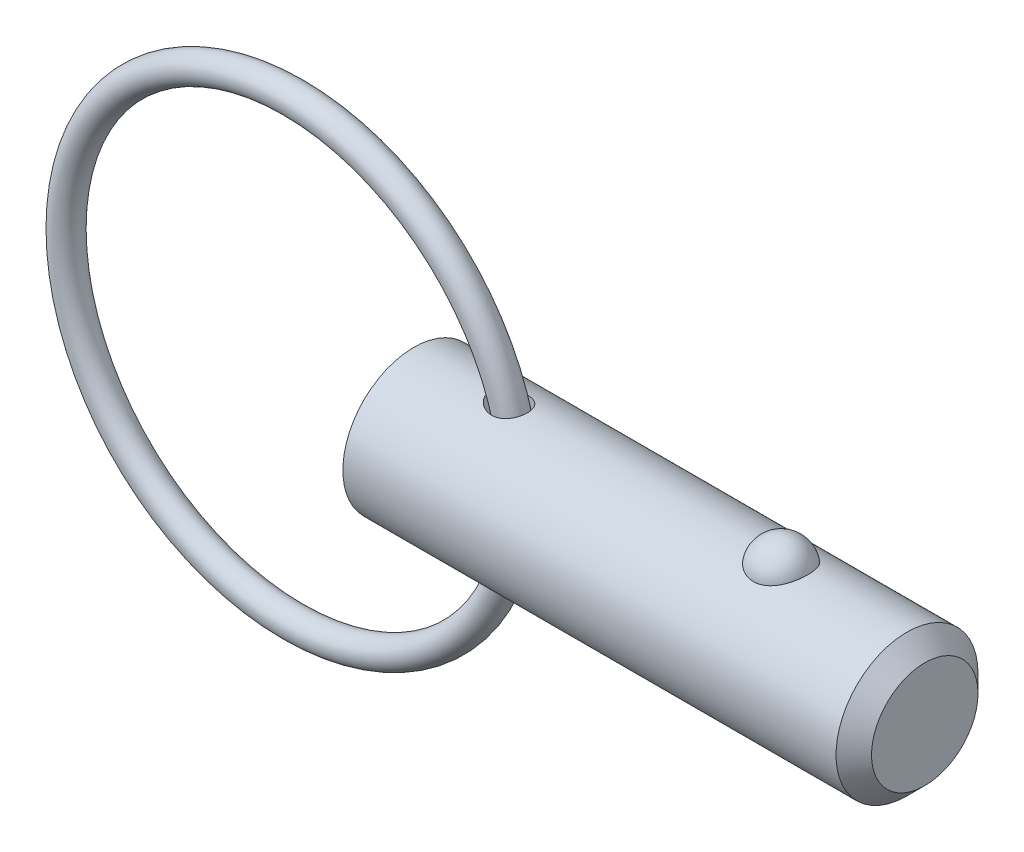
ISO-10303-21;
HEADER;
FILE_DESCRIPTION(('STEP AP214'),'2;1');
FILE_NAME('part.step','',(''),(''),'','','');
FILE_SCHEMA(('AUTOMOTIVE_DESIGN { 1 0 10303 214 1 1 1 1 }'));
ENDSEC;
DATA;
#1=APPLICATION_CONTEXT('core data for automotive mechanical design processes');
#2=APPLICATION_PROTOCOL_DEFINITION('international standard','automotive_design',2000,#1);
#3=PRODUCT_CONTEXT('',#1,'mechanical');
#4=PRODUCT('Part','Part','',(#3));
#5=PRODUCT_RELATED_PRODUCT_CATEGORY('part','',(#4));
#6=PRODUCT_DEFINITION_FORMATION('','',#4);
#7=PRODUCT_DEFINITION_CONTEXT('part definition',#1,'design');
#8=PRODUCT_DEFINITION('design','',#6,#7);
#9=PRODUCT_DEFINITION_SHAPE('','',#8);
#10=(LENGTH_UNIT() NAMED_UNIT(*) SI_UNIT(.MILLI.,.METRE.));
#11=(NAMED_UNIT(*) PLANE_ANGLE_UNIT() SI_UNIT($,.RADIAN.));
#12=(NAMED_UNIT(*) SI_UNIT($,.STERADIAN.) SOLID_ANGLE_UNIT());
#13=UNCERTAINTY_MEASURE_WITH_UNIT(LENGTH_MEASURE(1.E-05),#10,'distance_accuracy_value','');
#14=(GEOMETRIC_REPRESENTATION_CONTEXT(3) GLOBAL_UNCERTAINTY_ASSIGNED_CONTEXT((#13)) GLOBAL_UNIT_ASSIGNED_CONTEXT((#10,
#11,#12)) REPRESENTATION_CONTEXT('',''));
#15=CARTESIAN_POINT('',(0.,0.,0.));
#16=DIRECTION('',(0.,0.,1.));
#17=DIRECTION('',(1.,0.,0.));
#18=AXIS2_PLACEMENT_3D('',#15,#16,#17);
#19=CARTESIAN_POINT('',(-6.75433730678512,0.,0.));
#20=DIRECTION('',(0.,0.,1.));
#21=DIRECTION('',(1.,0.,0.));
#22=AXIS2_PLACEMENT_3D('',#19,#20,#21);
#23=TOROIDAL_SURFACE('',#22,12.7,0.794);
#24=CARTESIAN_POINT('',(6.73966269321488,0.,0.));
#25=VERTEX_POINT('',#24);
#26=VERTEX_LOOP('',#25);
#27=FACE_BOUND('',#26,.T.);
#28=ADVANCED_FACE('P0_F12',(#27),#23,.T.);
#29=CLOSED_SHELL('',(#28));
#30=MANIFOLD_SOLID_BREP('P0_B1',#29);
#31=CARTESIAN_POINT('',(0.,0.,0.));
#32=DIRECTION('',(1.,0.,0.));
#33=DIRECTION('',(0.,0.,-1.));
#34=AXIS2_PLACEMENT_3D('',#31,#32,#33);
#35=CYLINDRICAL_SURFACE('',#34,3.97);
#36=CARTESIAN_POINT('',(4.50613409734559,3.92152479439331,-0.618499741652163));
#37=CARTESIAN_POINT('',(4.54853517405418,3.91408351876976,-0.665679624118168));
#38=CARTESIAN_POINT('',(4.59520918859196,3.90637054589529,-0.709047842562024));
#39=CARTESIAN_POINT('',(4.69529850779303,3.89134328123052,-0.787367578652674));
#40=CARTESIAN_POINT('',(4.74872860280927,3.88402991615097,-0.822300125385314));
#41=CARTESIAN_POINT('',(4.86059505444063,3.87069188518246,-0.882953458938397));
#42=CARTESIAN_POINT('',(4.91902090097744,3.86466460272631,-0.908693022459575));
#43=CARTESIAN_POINT('',(5.03942053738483,3.85463812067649,-0.950329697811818));
#44=CARTESIAN_POINT('',(5.10139227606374,3.85063776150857,-0.966232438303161));
#45=CARTESIAN_POINT('',(5.22799334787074,3.84521819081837,-0.987584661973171));
#46=CARTESIAN_POINT('',(5.29264515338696,3.84382942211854,-0.992910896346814));
#47=CARTESIAN_POINT('',(5.4218778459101,3.84405510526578,-0.992040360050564));
#48=CARTESIAN_POINT('',(5.48645875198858,3.84566813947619,-0.985849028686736));
#49=CARTESIAN_POINT('',(5.60832575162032,3.85155853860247,-0.962561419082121));
#50=CARTESIAN_POINT('',(5.66579014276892,3.85562063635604,-0.946343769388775));
#51=CARTESIAN_POINT('',(5.77675338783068,3.86576598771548,-0.904004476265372));
#52=CARTESIAN_POINT('',(5.83025379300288,3.87184844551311,-0.877886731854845));
#53=CARTESIAN_POINT('',(5.92811265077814,3.88482601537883,-0.818464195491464));
#54=CARTESIAN_POINT('',(5.97284196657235,3.89164057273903,-0.785750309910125));
#55=CARTESIAN_POINT('',(6.05599619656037,3.90559314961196,-0.713164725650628));
#56=CARTESIAN_POINT('',(6.09442162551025,3.91273114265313,-0.673293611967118));
#57=CARTESIAN_POINT('',(6.16349552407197,3.92643411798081,-0.588089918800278));
#58=CARTESIAN_POINT('',(6.19423746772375,3.93300527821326,-0.542833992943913));
#59=CARTESIAN_POINT('',(6.24784048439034,3.94496273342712,-0.447731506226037));
#60=CARTESIAN_POINT('',(6.27070130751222,3.95034899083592,-0.3978847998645));
#61=CARTESIAN_POINT('',(6.30819009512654,3.95940331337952,-0.294515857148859));
#62=CARTESIAN_POINT('',(6.32274046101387,3.96305513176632,-0.240964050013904));
#63=CARTESIAN_POINT('',(6.34295490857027,3.96817541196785,-0.132107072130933));
#64=CARTESIAN_POINT('',(6.3486187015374,3.96964380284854,-0.0768018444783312));
#65=CARTESIAN_POINT('',(6.35094049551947,3.97024250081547,0.0343098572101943));
#66=CARTESIAN_POINT('',(6.34754972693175,3.96936014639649,0.0901174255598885));
#67=CARTESIAN_POINT('',(6.33173352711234,3.9653248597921,0.200354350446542));
#68=CARTESIAN_POINT('',(6.31930791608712,3.96217188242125,0.254783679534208));
#69=CARTESIAN_POINT('',(6.28569545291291,3.95393415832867,0.360736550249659));
#70=CARTESIAN_POINT('',(6.26450524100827,3.94884867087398,0.412258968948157));
#71=CARTESIAN_POINT('',(6.21385621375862,3.93730247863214,0.510898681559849));
#72=CARTESIAN_POINT('',(6.18439757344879,3.93084180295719,0.558016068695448));
#73=CARTESIAN_POINT('',(6.11807283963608,3.91729312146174,0.646300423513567));
#74=CARTESIAN_POINT('',(6.08123803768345,3.91020783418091,0.687491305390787));
#75=CARTESIAN_POINT('',(6.00105036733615,3.89618447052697,0.762970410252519));
#76=CARTESIAN_POINT('',(5.95769831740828,3.88924637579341,0.79725949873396));
#77=CARTESIAN_POINT('',(5.8661353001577,3.87636375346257,0.857702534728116));
#78=CARTESIAN_POINT('',(5.81797537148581,3.87041026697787,0.883931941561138));
#79=CARTESIAN_POINT('',(5.71784316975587,3.86006042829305,0.928089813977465));
#80=CARTESIAN_POINT('',(5.66587104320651,3.85566401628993,0.946018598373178));
#81=CARTESIAN_POINT('',(5.55935910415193,3.84884784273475,0.973381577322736));
#82=CARTESIAN_POINT('',(5.50480823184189,3.84643760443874,0.982774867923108));
#83=CARTESIAN_POINT('',(5.39486598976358,3.84381055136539,0.992999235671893));
#84=CARTESIAN_POINT('',(5.33947443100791,3.84359423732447,0.993828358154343));
#85=CARTESIAN_POINT('',(5.2264823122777,3.84533176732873,0.987084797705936));
#86=CARTESIAN_POINT('',(5.16890896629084,3.84739412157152,0.979092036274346));
#87=CARTESIAN_POINT('',(5.05572652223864,3.85355237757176,0.954563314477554));
#88=CARTESIAN_POINT('',(5.00011821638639,3.85764908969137,0.938023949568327));
#89=CARTESIAN_POINT('',(4.88760177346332,3.86780726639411,0.895259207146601));
#90=CARTESIAN_POINT('',(4.83096658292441,3.87400321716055,0.868345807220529));
#91=CARTESIAN_POINT('',(4.72283286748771,3.88749324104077,0.805802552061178));
#92=CARTESIAN_POINT('',(4.6713374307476,3.89478796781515,0.770167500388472));
#93=CARTESIAN_POINT('',(4.57320957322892,3.90992457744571,0.689306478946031));
#94=CARTESIAN_POINT('',(4.52683185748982,3.91777672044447,0.643771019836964));
#95=CARTESIAN_POINT('',(4.44324307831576,3.93275681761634,0.544809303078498));
#96=CARTESIAN_POINT('',(4.40602610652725,3.939885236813,0.491388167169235));
#97=CARTESIAN_POINT('',(4.34571986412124,3.95183347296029,0.382912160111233));
#98=CARTESIAN_POINT('',(4.32168268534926,3.95680025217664,0.328404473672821));
#99=CARTESIAN_POINT('',(4.28478280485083,3.96454157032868,0.215602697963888));
#100=CARTESIAN_POINT('',(4.27190231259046,3.96731959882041,0.157314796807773));
#101=CARTESIAN_POINT('',(4.25937356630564,3.97002560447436,0.0481762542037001));
#102=CARTESIAN_POINT('',(4.25802727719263,3.97031923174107,-0.00247526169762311));
#103=CARTESIAN_POINT('',(4.26422295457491,3.96897737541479,-0.103210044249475));
#104=CARTESIAN_POINT('',(4.27176468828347,3.96734194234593,-0.153293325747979));
#105=CARTESIAN_POINT('',(4.29457390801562,3.96248430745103,-0.248530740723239));
#106=CARTESIAN_POINT('',(4.30937736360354,3.95935769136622,-0.293803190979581));
#107=CARTESIAN_POINT('',(4.34569993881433,3.95187968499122,-0.381417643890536));
#108=CARTESIAN_POINT('',(4.36721517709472,3.94752900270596,-0.42376132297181));
#109=CARTESIAN_POINT('',(4.40821696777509,3.93952317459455,-0.491758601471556));
#110=CARTESIAN_POINT('',(4.42613511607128,3.93609353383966,-0.518404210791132));
#111=CARTESIAN_POINT('',(4.46438343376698,3.92897396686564,-0.569857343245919));
#112=CARTESIAN_POINT('',(4.48471350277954,3.92528405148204,-0.594664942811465));
#113=CARTESIAN_POINT('',(4.50613409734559,3.92152479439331,-0.618499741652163));
#114=B_SPLINE_CURVE_WITH_KNOTS('',3,(#36,#37,#38,#39,#40,#41,#42,#43,#44,#45,#46,#47,#48,#49,
#50,#51,#52,#53,#54,#55,#56,#57,#58,#59,#60,#61,#62,#63,#64,#65,#66,#67,#68,#69,#70,#71,#72,#73,
#74,#75,#76,#77,#78,#79,#80,#81,#82,#83,#84,#85,#86,#87,#88,#89,#90,#91,#92,#93,#94,#95,#96,#97,
#98,#99,#100,#101,#102,#103,#104,#105,#106,#107,#108,#109,#110,#111,#112,#113),.UNSPECIFIED.,
.T.,.F.,(4,2,2,2,2,2,2,2,2,2,2,2,2,2,2,2,2,2,2,2,2,2,2,2,2,2,2,2,2,2,2,2,2,2,2,2,2,2,4),(0.,
0.191481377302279,0.383389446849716,0.574903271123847,0.766307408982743,0.959929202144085,
1.15345957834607,1.33205157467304,1.51057330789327,1.67726576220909,1.84394459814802,
2.00848443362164,2.17302948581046,2.33908685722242,2.50514962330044,2.6721086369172,
2.83907097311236,3.00609737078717,3.17312023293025,3.33944900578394,3.5057569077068,
3.67045663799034,3.83515004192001,4.00062859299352,4.16614491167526,4.33989638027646,
4.51371711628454,4.70191549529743,4.8902262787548,5.08559712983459,5.28084164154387,
5.45908728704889,5.63704817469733,5.78825771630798,5.93946329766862,6.08206496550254,
6.22458432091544,6.32132279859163,6.41805725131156),.UNSPECIFIED.);
#115=CARTESIAN_POINT('',(4.50613409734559,3.92152479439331,-0.618499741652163));
#116=VERTEX_POINT('',#115);
#117=EDGE_CURVE('P1_E40',#116,#116,#114,.T.);
#118=ORIENTED_EDGE('',*,*,#117,.T.);
#119=EDGE_LOOP('',(#118));
#120=FACE_BOUND('',#119,.T.);
#121=CARTESIAN_POINT('',(27.5875,0.,0.));
#122=DIRECTION('',(1.,0.,0.));
#123=DIRECTION('',(0.,0.,-1.));
#124=AXIS2_PLACEMENT_3D('',#121,#122,#123);
#125=CIRCLE('',#124,3.97);
#126=CARTESIAN_POINT('',(27.5875,0.,-3.97));
#127=VERTEX_POINT('',#126);
#128=EDGE_CURVE('P1_E25',#127,#127,#125,.T.);
#129=ORIENTED_EDGE('',*,*,#128,.F.);
#130=EDGE_LOOP('',(#129));
#131=FACE_BOUND('',#130,.T.);
#132=CARTESIAN_POINT('',(0.,0.,0.));
#133=DIRECTION('',(1.,0.,0.));
#134=DIRECTION('',(0.,0.,-1.));
#135=AXIS2_PLACEMENT_3D('',#132,#133,#134);
#136=CIRCLE('',#135,3.97);
#137=CARTESIAN_POINT('',(0.,0.,-3.97));
#138=VERTEX_POINT('',#137);
#139=EDGE_CURVE('P1_E9',#138,#138,#136,.T.);
#140=ORIENTED_EDGE('',*,*,#139,.T.);
#141=EDGE_LOOP('',(#140));
#142=FACE_BOUND('',#141,.T.);
#143=CARTESIAN_POINT('',(20.5451922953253,3.65715365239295,1.54470941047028));
#144=CARTESIAN_POINT('',(20.4652448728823,3.65716001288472,1.54470290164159));
#145=CARTESIAN_POINT('',(20.3851650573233,3.65987074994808,1.53832549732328));
#146=CARTESIAN_POINT('',(20.2272374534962,3.6704221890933,1.51297018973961));
#147=CARTESIAN_POINT('',(20.1493961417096,3.67827646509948,1.49395894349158));
#148=CARTESIAN_POINT('',(19.9984614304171,3.69818848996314,1.44395950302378));
#149=CARTESIAN_POINT('',(19.9253560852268,3.71023513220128,1.41300293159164));
#150=CARTESIAN_POINT('',(19.7855630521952,3.7372183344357,1.34000212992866));
#151=CARTESIAN_POINT('',(19.7188725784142,3.75215363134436,1.29796274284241));
#152=CARTESIAN_POINT('',(19.5914886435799,3.78384968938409,1.20248834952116));
#153=CARTESIAN_POINT('',(19.5310299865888,3.80065129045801,1.14875388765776));
#154=CARTESIAN_POINT('',(19.4196942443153,3.83398532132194,1.03205417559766));
#155=CARTESIAN_POINT('',(19.3688200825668,3.85051766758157,0.969086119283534));
#156=CARTESIAN_POINT('',(19.2756321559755,3.88238608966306,0.832526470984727));
#157=CARTESIAN_POINT('',(19.2337961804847,3.89763698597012,0.758588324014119));
#158=CARTESIAN_POINT('',(19.1625108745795,3.92451063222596,0.604352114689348));
#159=CARTESIAN_POINT('',(19.1330623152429,3.93613315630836,0.524053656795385));
#160=CARTESIAN_POINT('',(19.0868927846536,3.95467606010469,0.358403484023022));
#161=CARTESIAN_POINT('',(19.0703127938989,3.96154426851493,0.273006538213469));
#162=CARTESIAN_POINT('',(19.050756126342,3.96967008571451,0.100408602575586));
#163=CARTESIAN_POINT('',(19.0477789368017,3.97092790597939,0.0132076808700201));
#164=CARTESIAN_POINT('',(19.0554587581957,3.96771794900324,-0.15984454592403));
#165=CARTESIAN_POINT('',(19.0660164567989,3.96329187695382,-0.245701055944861));
#166=CARTESIAN_POINT('',(19.1003800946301,3.94923163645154,-0.414277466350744));
#167=CARTESIAN_POINT('',(19.1241862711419,3.9395973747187,-0.496997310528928));
#168=CARTESIAN_POINT('',(19.1846114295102,3.91607752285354,-0.657113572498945));
#169=CARTESIAN_POINT('',(19.2212495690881,3.90218558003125,-0.734501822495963));
#170=CARTESIAN_POINT('',(19.3065935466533,3.87158287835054,-0.881704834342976));
#171=CARTESIAN_POINT('',(19.3553004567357,3.8548718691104,-0.95151892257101));
#172=CARTESIAN_POINT('',(19.4641161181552,3.82028735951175,-1.08208159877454));
#173=CARTESIAN_POINT('',(19.5242955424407,3.80240713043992,-1.14276958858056));
#174=CARTESIAN_POINT('',(19.654493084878,3.76758161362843,-1.2528243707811));
#175=CARTESIAN_POINT('',(19.7245105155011,3.75063626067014,-1.30219195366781));
#176=CARTESIAN_POINT('',(19.87118160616,3.71998948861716,-1.38729709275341));
#177=CARTESIAN_POINT('',(19.9476813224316,3.70623183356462,-1.42327904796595));
#178=CARTESIAN_POINT('',(20.1062981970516,3.68323188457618,-1.48178996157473));
#179=CARTESIAN_POINT('',(20.1884132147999,3.67398788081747,-1.5043240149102));
#180=CARTESIAN_POINT('',(20.3514810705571,3.6615216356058,-1.53440939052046));
#181=CARTESIAN_POINT('',(20.4322840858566,3.65801951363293,-1.54265826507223));
#182=CARTESIAN_POINT('',(20.5942085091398,3.65657341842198,-1.5460842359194));
#183=CARTESIAN_POINT('',(20.6753298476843,3.65862829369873,-1.54126404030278));
#184=CARTESIAN_POINT('',(20.8328122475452,3.66788969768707,-1.51908474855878));
#185=CARTESIAN_POINT('',(20.9092422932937,3.67492621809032,-1.50213925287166));
#186=CARTESIAN_POINT('',(21.0580412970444,3.69318404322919,-1.45666982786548));
#187=CARTESIAN_POINT('',(21.1304099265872,3.70440568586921,-1.42814496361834));
#188=CARTESIAN_POINT('',(21.2708029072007,3.73012749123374,-1.35956319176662));
#189=CARTESIAN_POINT('',(21.3387000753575,3.74469307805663,-1.31927107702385));
#190=CARTESIAN_POINT('',(21.4668649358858,3.77545272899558,-1.22847440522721));
#191=CARTESIAN_POINT('',(21.5271308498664,3.79164717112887,-1.17796747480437));
#192=CARTESIAN_POINT('',(21.6416346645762,3.82490325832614,-1.06519260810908));
#193=CARTESIAN_POINT('',(21.6954137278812,3.84196735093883,-1.00245914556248));
#194=CARTESIAN_POINT('',(21.7920988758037,3.87439863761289,-0.868715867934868));
#195=CARTESIAN_POINT('',(21.8350030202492,3.88976552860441,-0.797704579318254));
#196=CARTESIAN_POINT('',(21.910266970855,3.91771381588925,-0.646896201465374));
#197=CARTESIAN_POINT('',(21.9422532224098,3.93019255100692,-0.566893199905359));
#198=CARTESIAN_POINT('',(21.9931101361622,3.95043886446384,-0.402255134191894));
#199=CARTESIAN_POINT('',(22.0119807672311,3.95820643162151,-0.317620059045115));
#200=CARTESIAN_POINT('',(22.0362162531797,3.96823733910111,-0.146156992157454));
#201=CARTESIAN_POINT('',(22.0415874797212,3.970503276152,-0.0593300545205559));
#202=CARTESIAN_POINT('',(22.0387309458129,3.96930811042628,0.114057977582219));
#203=CARTESIAN_POINT('',(22.0305035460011,3.9658471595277,0.200619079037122));
#204=CARTESIAN_POINT('',(22.0007063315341,3.95358562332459,0.370506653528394));
#205=CARTESIAN_POINT('',(21.9792129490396,3.94481563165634,0.453848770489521));
#206=CARTESIAN_POINT('',(21.9233839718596,3.92284586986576,0.615497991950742));
#207=CARTESIAN_POINT('',(21.8890474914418,3.90964579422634,0.693804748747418));
#208=CARTESIAN_POINT('',(21.8079702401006,3.88006987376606,0.843703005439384));
#209=CARTESIAN_POINT('',(21.7611536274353,3.86367478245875,0.915249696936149));
#210=CARTESIAN_POINT('',(21.6561897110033,3.82949741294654,1.04910810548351));
#211=CARTESIAN_POINT('',(21.5980428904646,3.81171519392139,1.11142021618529));
#212=CARTESIAN_POINT('',(21.4717433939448,3.77673366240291,1.22503948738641));
#213=CARTESIAN_POINT('',(21.4035970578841,3.75953398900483,1.2763535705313));
#214=CARTESIAN_POINT('',(21.2589009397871,3.72770506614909,1.36653336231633));
#215=CARTESIAN_POINT('',(21.182348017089,3.71307678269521,1.40539439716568));
#216=CARTESIAN_POINT('',(21.0257594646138,3.68864287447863,1.46830480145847));
#217=CARTESIAN_POINT('',(20.9459307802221,3.67869017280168,1.49281289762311));
#218=CARTESIAN_POINT('',(20.7829877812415,3.66414535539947,1.52817474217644));
#219=CARTESIAN_POINT('',(20.6998840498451,3.65953723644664,1.53906926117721));
#220=CARTESIAN_POINT('',(20.5927760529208,3.6573894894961,1.54414878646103));
#221=CARTESIAN_POINT('',(20.5689900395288,3.65715175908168,1.54471134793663));
#222=CARTESIAN_POINT('',(20.5451922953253,3.65715365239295,1.54470941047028));
#223=B_SPLINE_CURVE_WITH_KNOTS('',3,(#143,#144,#145,#146,#147,#148,#149,#150,#151,#152,#153,
#154,#155,#156,#157,#158,#159,#160,#161,#162,#163,#164,#165,#166,#167,#168,#169,#170,#171,#172,
#173,#174,#175,#176,#177,#178,#179,#180,#181,#182,#183,#184,#185,#186,#187,#188,#189,#190,#191,
#192,#193,#194,#195,#196,#197,#198,#199,#200,#201,#202,#203,#204,#205,#206,#207,#208,#209,#210,
#211,#212,#213,#214,#215,#216,#217,#218,#219,#220,#221,#222),.UNSPECIFIED.,.T.,.F.,(4,2,2,2,2,2,
2,2,2,2,2,2,2,2,2,2,2,2,2,2,2,2,2,2,2,2,2,2,2,2,2,2,2,2,2,2,2,2,2,4),(0.,0.239777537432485,
0.480190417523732,0.719971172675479,0.959647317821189,1.20639040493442,1.45320863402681,
1.7109367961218,1.96868099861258,2.22921052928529,2.4897302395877,2.74834928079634,
3.00697295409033,3.26598440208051,3.52501886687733,3.78570385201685,4.04637062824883,
4.30201257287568,4.55755760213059,4.80022994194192,5.04285200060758,5.27757006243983,
5.51230707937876,5.75210128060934,5.99195126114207,6.24392810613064,6.49594987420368,
6.75588818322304,7.0158271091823,7.27564332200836,7.53545264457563,7.79377886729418,
8.05212290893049,8.31207418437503,8.57201437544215,8.83179046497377,9.09166393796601,
9.34270057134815,9.59298357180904,9.66435753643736),.UNSPECIFIED.);
#224=CARTESIAN_POINT('',(20.5451922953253,3.65715365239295,1.54470941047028));
#225=VERTEX_POINT('',#224);
#226=EDGE_CURVE('P1_E34',#225,#225,#223,.T.);
#227=ORIENTED_EDGE('',*,*,#226,.T.);
#228=EDGE_LOOP('',(#227));
#229=FACE_BOUND('',#228,.T.);
#230=CARTESIAN_POINT('',(4.50613409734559,-3.92152479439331,-0.618499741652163));
#231=CARTESIAN_POINT('',(4.47063221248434,-3.92775524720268,-0.57899519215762));
#232=CARTESIAN_POINT('',(4.43810149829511,-3.93379908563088,-0.536794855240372));
#233=CARTESIAN_POINT('',(4.38017497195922,-3.94493883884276,-0.447628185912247));
#234=CARTESIAN_POINT('',(4.3547746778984,-3.95003534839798,-0.400664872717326));
#235=CARTESIAN_POINT('',(4.3122178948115,-3.95875465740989,-0.302642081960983));
#236=CARTESIAN_POINT('',(4.29511088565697,-3.96236859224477,-0.251560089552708));
#237=CARTESIAN_POINT('',(4.27046538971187,-3.96762012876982,-0.14703606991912));
#238=CARTESIAN_POINT('',(4.26292104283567,-3.96925894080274,-0.0935955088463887));
#239=CARTESIAN_POINT('',(4.25814817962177,-3.97029345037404,0.00916757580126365));
#240=CARTESIAN_POINT('',(4.26009234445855,-3.96986905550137,0.058451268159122));
#241=CARTESIAN_POINT('',(4.27229463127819,-3.96723648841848,0.15592126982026));
#242=CARTESIAN_POINT('',(4.28255257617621,-3.96502835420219,0.204107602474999));
#243=CARTESIAN_POINT('',(4.31040382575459,-3.95915538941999,0.296804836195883));
#244=CARTESIAN_POINT('',(4.32779766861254,-3.95553028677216,0.341378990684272));
#245=CARTESIAN_POINT('',(4.36906896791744,-3.94717481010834,0.427290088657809));
#246=CARTESIAN_POINT('',(4.39294824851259,-3.94244412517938,0.468626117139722));
#247=CARTESIAN_POINT('',(4.44891306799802,-3.93178155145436,0.551268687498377));
#248=CARTESIAN_POINT('',(4.48157347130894,-3.92577737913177,0.592175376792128));
#249=CARTESIAN_POINT('',(4.5525111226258,-3.91346489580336,0.668729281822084));
#250=CARTESIAN_POINT('',(4.59079150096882,-3.90715641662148,0.704373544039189));
#251=CARTESIAN_POINT('',(4.67775521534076,-3.89387548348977,0.774654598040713));
#252=CARTESIAN_POINT('',(4.72714377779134,-3.88693620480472,0.808427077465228));
#253=CARTESIAN_POINT('',(4.83064277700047,-3.8740635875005,0.868022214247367));
#254=CARTESIAN_POINT('',(4.88475591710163,-3.86813083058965,0.893840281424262));
#255=CARTESIAN_POINT('',(5.00110106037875,-3.85749476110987,0.93872983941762));
#256=CARTESIAN_POINT('',(5.06363405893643,-3.85293457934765,0.957062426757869));
#257=CARTESIAN_POINT('',(5.19104406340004,-3.84642688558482,0.98289453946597));
#258=CARTESIAN_POINT('',(5.25592057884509,-3.84447883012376,0.990396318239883));
#259=CARTESIAN_POINT('',(5.38389367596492,-3.84360582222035,0.993779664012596));
#260=CARTESIAN_POINT('',(5.44697893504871,-3.84458391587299,0.990033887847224));
#261=CARTESIAN_POINT('',(5.57135239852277,-3.84935403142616,0.971322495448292));
#262=CARTESIAN_POINT('',(5.63264168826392,-3.85314431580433,0.956363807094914));
#263=CARTESIAN_POINT('',(5.74616757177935,-3.86267246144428,0.917075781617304));
#264=CARTESIAN_POINT('',(5.79873169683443,-3.86821908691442,0.893643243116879));
#265=CARTESIAN_POINT('',(5.89880370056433,-3.88065529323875,0.837987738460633));
#266=CARTESIAN_POINT('',(5.94631268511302,-3.88754457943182,0.805766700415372));
#267=CARTESIAN_POINT('',(6.03285109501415,-3.90151699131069,0.735052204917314));
#268=CARTESIAN_POINT('',(6.07216200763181,-3.90857818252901,0.696897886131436));
#269=CARTESIAN_POINT('',(6.14379115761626,-3.92238187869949,0.614461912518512));
#270=CARTESIAN_POINT('',(6.17610956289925,-3.92912439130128,0.570180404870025));
#271=CARTESIAN_POINT('',(6.23298117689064,-3.94155789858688,0.47670081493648));
#272=CARTESIAN_POINT('',(6.25752764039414,-3.94724797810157,0.427498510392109));
#273=CARTESIAN_POINT('',(6.29825018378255,-3.95695712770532,0.325589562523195));
#274=CARTESIAN_POINT('',(6.31442591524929,-3.96097612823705,0.272882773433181));
#275=CARTESIAN_POINT('',(6.33815165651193,-3.96694319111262,0.164947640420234));
#276=CARTESIAN_POINT('',(6.34562253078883,-3.96887224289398,0.109700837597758));
#277=CARTESIAN_POINT('',(6.35150690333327,-3.97038782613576,-0.00130546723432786));
#278=CARTESIAN_POINT('',(6.34992017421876,-3.96997429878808,-0.0570649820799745));
#279=CARTESIAN_POINT('',(6.33770614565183,-3.96684417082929,-0.167685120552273));
#280=CARTESIAN_POINT('',(6.32705245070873,-3.96412084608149,-0.222542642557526));
#281=CARTESIAN_POINT('',(6.29690849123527,-3.95665587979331,-0.329631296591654));
#282=CARTESIAN_POINT('',(6.27741810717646,-3.95191421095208,-0.381862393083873));
#283=CARTESIAN_POINT('',(6.2300755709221,-3.94093577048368,-0.482151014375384));
#284=CARTESIAN_POINT('',(6.20223216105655,-3.93470056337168,-0.530212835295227));
#285=CARTESIAN_POINT('',(6.13885089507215,-3.92142345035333,-0.620836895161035));
#286=CARTESIAN_POINT('',(6.10331353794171,-3.9143815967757,-0.663399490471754));
#287=CARTESIAN_POINT('',(6.02573506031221,-3.90033441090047,-0.741525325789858));
#288=CARTESIAN_POINT('',(5.98374081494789,-3.89332916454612,-0.777135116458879));
#289=CARTESIAN_POINT('',(5.89422937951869,-3.88009391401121,-0.840731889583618));
#290=CARTESIAN_POINT('',(5.84671289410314,-3.87386381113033,-0.868719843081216));
#291=CARTESIAN_POINT('',(5.74792005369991,-3.86290904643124,-0.916201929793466));
#292=CARTESIAN_POINT('',(5.69667597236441,-3.85817300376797,-0.935760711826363));
#293=CARTESIAN_POINT('',(5.59158164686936,-3.85061943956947,-0.966374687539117));
#294=CARTESIAN_POINT('',(5.53773121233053,-3.84780205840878,-0.97742925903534));
#295=CARTESIAN_POINT('',(5.42780663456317,-3.844282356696,-0.991183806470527));
#296=CARTESIAN_POINT('',(5.37170954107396,-3.84362414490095,-0.993709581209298));
#297=CARTESIAN_POINT('',(5.25980914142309,-3.84452352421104,-0.990222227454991));
#298=CARTESIAN_POINT('',(5.20400591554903,-3.84608169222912,-0.984206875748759));
#299=CARTESIAN_POINT('',(5.09021941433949,-3.85134557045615,-0.963410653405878));
#300=CARTESIAN_POINT('',(5.0323470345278,-3.85519050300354,-0.948059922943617));
#301=CARTESIAN_POINT('',(4.9197292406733,-3.86464451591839,-0.908751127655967));
#302=CARTESIAN_POINT('',(4.86498619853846,-3.87025491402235,-0.884786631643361));
#303=CARTESIAN_POINT('',(4.75497621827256,-3.88320265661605,-0.826208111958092));
#304=CARTESIAN_POINT('',(4.70013922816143,-3.89065244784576,-0.790807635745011));
#305=CARTESIAN_POINT('',(4.59743373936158,-3.90600301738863,-0.711112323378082));
#306=CARTESIAN_POINT('',(4.54956105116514,-3.91390352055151,-0.66682287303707));
#307=CARTESIAN_POINT('',(4.50613409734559,-3.92152479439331,-0.618499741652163));
#308=B_SPLINE_CURVE_WITH_KNOTS('',3,(#230,#231,#232,#233,#234,#235,#236,#237,#238,#239,#240,
#241,#242,#243,#244,#245,#246,#247,#248,#249,#250,#251,#252,#253,#254,#255,#256,#257,#258,#259,
#260,#261,#262,#263,#264,#265,#266,#267,#268,#269,#270,#271,#272,#273,#274,#275,#276,#277,#278,
#279,#280,#281,#282,#283,#284,#285,#286,#287,#288,#289,#290,#291,#292,#293,#294,#295,#296,#297,
#298,#299,#300,#301,#302,#303,#304,#305,#306,#307),.UNSPECIFIED.,.T.,.F.,(4,2,2,2,2,2,2,2,2,2,2,
2,2,2,2,2,2,2,2,2,2,2,2,2,2,2,2,2,2,2,2,2,2,2,2,2,2,2,4),(0.,0.160252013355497,
0.320403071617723,0.481498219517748,0.642494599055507,0.789717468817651,0.936937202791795,
1.08029540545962,1.22369397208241,1.38114509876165,1.53868426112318,1.7186296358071,
1.89867865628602,2.09368931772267,2.28865940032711,2.47724174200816,2.66570766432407,
2.83827720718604,3.01080892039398,3.17573461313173,3.34065634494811,3.50572082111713,
3.67079216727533,3.83735274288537,4.00391749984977,4.17096882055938,4.33802240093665,
4.50490174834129,4.6717702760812,4.83748008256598,5.0031687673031,5.16756302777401,
5.3319693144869,5.49971393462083,5.66750222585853,5.84673431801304,6.02610050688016,
6.22224398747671,6.41826898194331),.UNSPECIFIED.);
#309=CARTESIAN_POINT('',(4.50613409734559,-3.92152479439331,-0.618499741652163));
#310=VERTEX_POINT('',#309);
#311=EDGE_CURVE('P1_E17',#310,#310,#308,.T.);
#312=ORIENTED_EDGE('',*,*,#311,.T.);
#313=EDGE_LOOP('',(#312));
#314=FACE_BOUND('',#313,.T.);
#315=ADVANCED_FACE('P1_F13',(#120,#131,#142,#229,#314),#35,.T.);
#316=CARTESIAN_POINT('',(0.,0.,0.));
#317=DIRECTION('',(-1.,0.,0.));
#318=DIRECTION('',(0.,0.,1.));
#319=AXIS2_PLACEMENT_3D('',#316,#317,#318);
#320=PLANE('',#319);
#321=ORIENTED_EDGE('',*,*,#139,.F.);
#322=EDGE_LOOP('',(#321));
#323=FACE_BOUND('',#322,.T.);
#324=ADVANCED_FACE('P1_F15',(#323),#320,.T.);
#325=CARTESIAN_POINT('',(28.58,0.,0.));
#326=DIRECTION('',(-1.,0.,0.));
#327=DIRECTION('',(0.,0.,1.));
#328=AXIS2_PLACEMENT_3D('',#325,#326,#327);
#329=CONICAL_SURFACE('',#328,2.9775,0.78539816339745);
#330=ORIENTED_EDGE('',*,*,#128,.T.);
#331=EDGE_LOOP('',(#330));
#332=FACE_BOUND('',#331,.T.);
#333=CARTESIAN_POINT('',(28.58,0.,0.));
#334=DIRECTION('',(1.,0.,0.));
#335=DIRECTION('',(0.,0.,-1.));
#336=AXIS2_PLACEMENT_3D('',#333,#334,#335);
#337=CIRCLE('',#336,2.9775);
#338=CARTESIAN_POINT('',(28.58,0.,-2.9775));
#339=VERTEX_POINT('',#338);
#340=EDGE_CURVE('P1_E30',#339,#339,#337,.T.);
#341=ORIENTED_EDGE('',*,*,#340,.F.);
#342=EDGE_LOOP('',(#341));
#343=FACE_BOUND('',#342,.T.);
#344=ADVANCED_FACE('P1_F55',(#332,#343),#329,.T.);
#345=CARTESIAN_POINT('',(28.58,2.9775,0.));
#346=DIRECTION('',(1.,0.,0.));
#347=DIRECTION('',(0.,0.,-1.));
#348=AXIS2_PLACEMENT_3D('',#345,#346,#347);
#349=PLANE('',#348);
#350=ORIENTED_EDGE('',*,*,#340,.T.);
#351=EDGE_LOOP('',(#350));
#352=FACE_BOUND('',#351,.T.);
#353=ADVANCED_FACE('P1_F51',(#352),#349,.T.);
#354=CARTESIAN_POINT('',(20.5451922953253,3.573,0.));
#355=DIRECTION('',(-1.,0.,0.));
#356=DIRECTION('',(0.,1.,0.));
#357=AXIS2_PLACEMENT_3D('',#354,#355,#356);
#358=SPHERICAL_SURFACE('',#357,1.54699999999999);
#359=ORIENTED_EDGE('',*,*,#226,.F.);
#360=EDGE_LOOP('',(#359));
#361=FACE_BOUND('',#360,.T.);
#362=ADVANCED_FACE('P1_F46',(#361),#358,.T.);
#363=CARTESIAN_POINT('',(-6.75433730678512,0.,0.));
#364=DIRECTION('',(0.,0.,1.));
#365=DIRECTION('',(1.,0.,0.));
#366=AXIS2_PLACEMENT_3D('',#363,#364,#365);
#367=TOROIDAL_SURFACE('',#366,12.7,0.9925);
#368=ORIENTED_EDGE('',*,*,#311,.F.);
#369=EDGE_LOOP('',(#368));
#370=FACE_BOUND('',#369,.T.);
#371=ORIENTED_EDGE('',*,*,#117,.F.);
#372=EDGE_LOOP('',(#371));
#373=FACE_BOUND('',#372,.T.);
#374=ADVANCED_FACE('P1_F50',(#370,#373),#367,.F.);
#375=CLOSED_SHELL('',(#315,#324,#344,#353,#362,#374));
#376=MANIFOLD_SOLID_BREP('P1_B1',#375);
#377=ADVANCED_BREP_SHAPE_REPRESENTATION('',(#18,#30,#376),#14);
#378=SHAPE_DEFINITION_REPRESENTATION(#9,#377);
ENDSEC;
END-ISO-10303-21;
